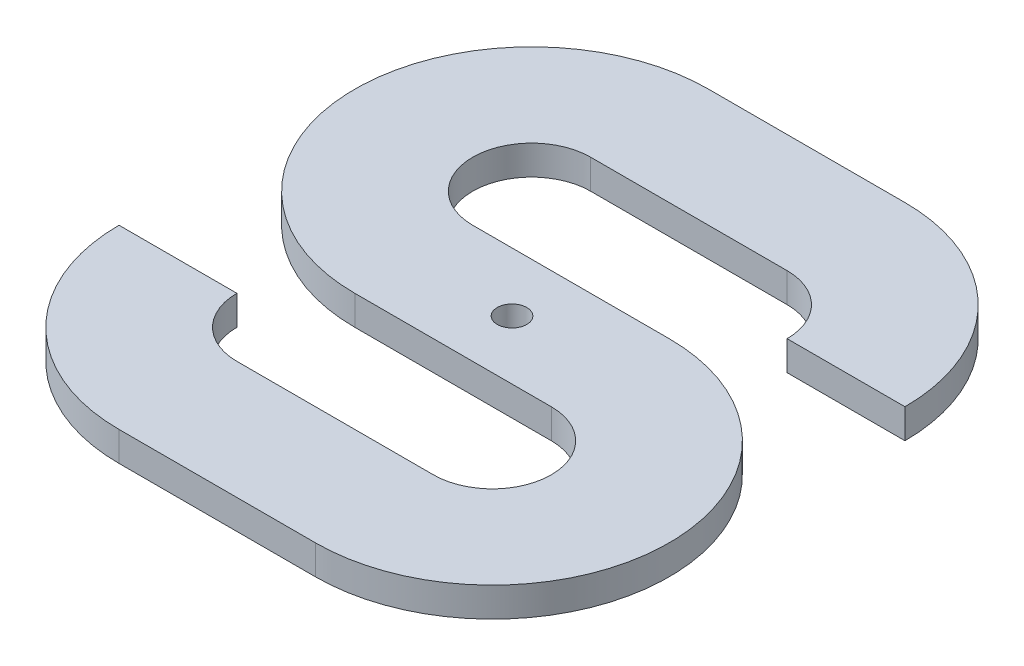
from build123d import *

# Parameters (mm, degrees)
SKETCH2_R      = 1.5
EXTRUDE1_DEPTH = 3


with BuildPart() as part:
    # Sketch2 → Extrude1 (new body)
    with BuildSketch(Plane(origin=(0, 0, 0), x_dir=(1, 0, 0), z_dir=(0, 1, 0))):
        with BuildLine():
            Line((18, 48), (38, 48))
            ThreePointArc((38, 48), (42.242640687, 46.242640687), (44, 42))
            Line((44, 42), (56, 42))
            ThreePointArc((56, 42), (50.727922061, 54.727922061), (38, 60))
            Line((38, 60), (18, 60))
            ThreePointArc((18, 60), (0, 42), (18, 24))
            Line((18, 24), (38, 24))
            ThreePointArc((38, 24), (44, 18), (38, 12))
            Line((38, 12), (18, 12))
            ThreePointArc((18, 12), (13.757359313, 13.757359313), (12, 18))
            Line((12, 18), (0, 18))
            ThreePointArc((0, 18), (5.272077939, 5.272077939), (18, 0))
            Line((18, 0), (38, 0))
            ThreePointArc((38, 0), (56, 18), (38, 36))
            Line((38, 36), (18, 36))
            ThreePointArc((18, 36), (12, 42), (18, 48))
        make_face()
        with Locations(Location((28, 30, 0), (0, 0, 270))):
            Circle(SKETCH2_R, mode=Mode.SUBTRACT)
    extrude(amount=EXTRUDE1_DEPTH)


solid = part.part
